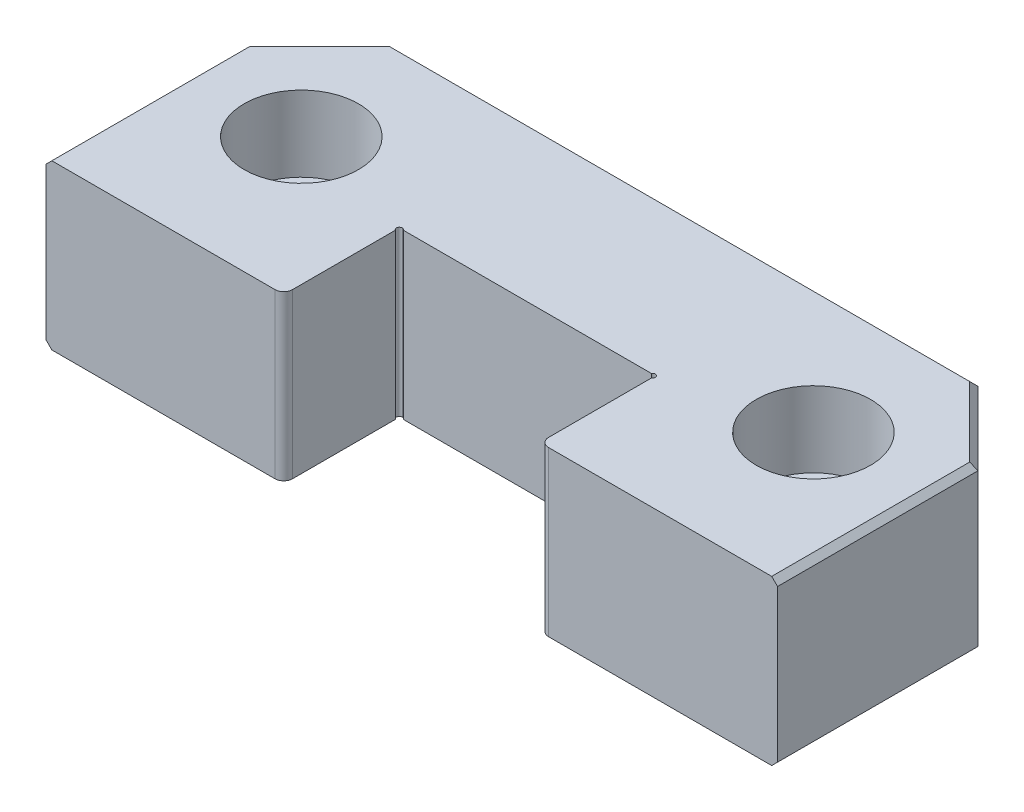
ISO-10303-21;
HEADER;
FILE_DESCRIPTION(('STEP AP214'),'2;1');
FILE_NAME('part.step','',(''),(''),'','','');
FILE_SCHEMA(('AUTOMOTIVE_DESIGN { 1 0 10303 214 1 1 1 1 }'));
ENDSEC;
DATA;
#1=APPLICATION_CONTEXT('core data for automotive mechanical design processes');
#2=APPLICATION_PROTOCOL_DEFINITION('international standard','automotive_design',2000,#1);
#3=PRODUCT_CONTEXT('',#1,'mechanical');
#4=PRODUCT('Part','Part','',(#3));
#5=PRODUCT_RELATED_PRODUCT_CATEGORY('part','',(#4));
#6=PRODUCT_DEFINITION_FORMATION('','',#4);
#7=PRODUCT_DEFINITION_CONTEXT('part definition',#1,'design');
#8=PRODUCT_DEFINITION('design','',#6,#7);
#9=PRODUCT_DEFINITION_SHAPE('','',#8);
#10=(LENGTH_UNIT() NAMED_UNIT(*) SI_UNIT(.MILLI.,.METRE.));
#11=(NAMED_UNIT(*) PLANE_ANGLE_UNIT() SI_UNIT($,.RADIAN.));
#12=(NAMED_UNIT(*) SI_UNIT($,.STERADIAN.) SOLID_ANGLE_UNIT());
#13=UNCERTAINTY_MEASURE_WITH_UNIT(LENGTH_MEASURE(1.E-05),#10,'distance_accuracy_value','');
#14=(GEOMETRIC_REPRESENTATION_CONTEXT(3) GLOBAL_UNCERTAINTY_ASSIGNED_CONTEXT((#13)) GLOBAL_UNIT_ASSIGNED_CONTEXT((#10,
#11,#12)) REPRESENTATION_CONTEXT('',''));
#15=CARTESIAN_POINT('',(0.,0.,0.));
#16=DIRECTION('',(0.,0.,1.));
#17=DIRECTION('',(1.,0.,0.));
#18=AXIS2_PLACEMENT_3D('',#15,#16,#17);
#19=CARTESIAN_POINT('',(-44.45,15.748,-25.273));
#20=DIRECTION('',(0.,-1.,0.));
#21=DIRECTION('',(0.,0.,-1.));
#22=AXIS2_PLACEMENT_3D('',#19,#20,#21);
#23=CYLINDRICAL_SURFACE('',#22,6.7437);
#24=CARTESIAN_POINT('',(-44.45,0.,-25.273));
#25=DIRECTION('',(0.,-1.,0.));
#26=DIRECTION('',(0.,0.,-1.));
#27=AXIS2_PLACEMENT_3D('',#24,#25,#26);
#28=CIRCLE('',#27,6.7437);
#29=CARTESIAN_POINT('',(-44.45,0.,-32.0167));
#30=VERTEX_POINT('',#29);
#31=EDGE_CURVE('E267',#30,#30,#28,.T.);
#32=ORIENTED_EDGE('',*,*,#31,.T.);
#33=EDGE_LOOP('',(#32));
#34=FACE_BOUND('',#33,.T.);
#35=CARTESIAN_POINT('',(-44.45,15.3416,-25.273));
#36=DIRECTION('',(0.,1.,0.));
#37=DIRECTION('',(0.,0.,1.));
#38=AXIS2_PLACEMENT_3D('',#35,#36,#37);
#39=CIRCLE('',#38,6.7437);
#40=CARTESIAN_POINT('',(-44.45,15.3416,-18.5293));
#41=VERTEX_POINT('',#40);
#42=EDGE_CURVE('E269',#41,#41,#39,.F.);
#43=ORIENTED_EDGE('',*,*,#42,.F.);
#44=EDGE_LOOP('',(#43));
#45=FACE_BOUND('',#44,.T.);
#46=ADVANCED_FACE('F32',(#34,#45),#23,.F.);
#47=CARTESIAN_POINT('',(44.45,15.748,-25.273));
#48=DIRECTION('',(0.,-1.,0.));
#49=DIRECTION('',(0.,0.,-1.));
#50=AXIS2_PLACEMENT_3D('',#47,#48,#49);
#51=CYLINDRICAL_SURFACE('',#50,6.7437);
#52=CARTESIAN_POINT('',(44.45,0.,-25.273));
#53=DIRECTION('',(0.,-1.,0.));
#54=DIRECTION('',(0.,0.,-1.));
#55=AXIS2_PLACEMENT_3D('',#52,#53,#54);
#56=CIRCLE('',#55,6.7437);
#57=CARTESIAN_POINT('',(44.45,0.,-32.0167));
#58=VERTEX_POINT('',#57);
#59=EDGE_CURVE('E178',#58,#58,#56,.T.);
#60=ORIENTED_EDGE('',*,*,#59,.T.);
#61=EDGE_LOOP('',(#60));
#62=FACE_BOUND('',#61,.T.);
#63=CARTESIAN_POINT('',(44.45,15.3416,-25.273));
#64=DIRECTION('',(0.,1.,0.));
#65=DIRECTION('',(0.,0.,1.));
#66=AXIS2_PLACEMENT_3D('',#63,#64,#65);
#67=CIRCLE('',#66,6.7437);
#68=CARTESIAN_POINT('',(44.45,15.3416,-18.5293));
#69=VERTEX_POINT('',#68);
#70=EDGE_CURVE('E264',#69,#69,#67,.F.);
#71=ORIENTED_EDGE('',*,*,#70,.F.);
#72=EDGE_LOOP('',(#71));
#73=FACE_BOUND('',#72,.T.);
#74=ADVANCED_FACE('F427',(#62,#73),#51,.F.);
#75=CARTESIAN_POINT('',(-63.5,28.448,0.));
#76=DIRECTION('',(0.,0.,-1.));
#77=DIRECTION('',(-1.,0.,0.));
#78=AXIS2_PLACEMENT_3D('',#75,#76,#77);
#79=PLANE('',#78);
#80=DIRECTION('',(0.,-1.,0.));
#81=VECTOR('',#80,1.);
#82=CARTESIAN_POINT('',(63.5,28.448,0.));
#83=LINE('',#82,#81);
#84=CARTESIAN_POINT('',(63.5,27.432,0.));
#85=VERTEX_POINT('',#84);
#86=CARTESIAN_POINT('',(63.5,1.01599999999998,0.));
#87=VERTEX_POINT('',#86);
#88=EDGE_CURVE('E213',#85,#87,#83,.T.);
#89=ORIENTED_EDGE('',*,*,#88,.F.);
#90=DIRECTION('',(-0.707106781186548,0.707106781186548,0.));
#91=VECTOR('',#90,1.);
#92=CARTESIAN_POINT('',(62.484,28.448,0.));
#93=LINE('',#92,#91);
#94=CARTESIAN_POINT('',(62.4839999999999,28.448,0.));
#95=VERTEX_POINT('',#94);
#96=EDGE_CURVE('E311',#85,#95,#93,.T.);
#97=ORIENTED_EDGE('',*,*,#96,.T.);
#98=DIRECTION('',(1.,0.,0.));
#99=VECTOR('',#98,1.);
#100=CARTESIAN_POINT('',(-63.5,28.448,0.));
#101=LINE('',#100,#99);
#102=CARTESIAN_POINT('',(23.749,28.448,0.));
#103=VERTEX_POINT('',#102);
#104=EDGE_CURVE('E214',#103,#95,#101,.T.);
#105=ORIENTED_EDGE('',*,*,#104,.F.);
#106=DIRECTION('',(0.,-1.,0.));
#107=VECTOR('',#106,1.);
#108=CARTESIAN_POINT('',(23.749,28.448,0.));
#109=LINE('',#108,#107);
#110=CARTESIAN_POINT('',(23.749,0.,0.));
#111=VERTEX_POINT('',#110);
#112=EDGE_CURVE('E258',#103,#111,#109,.T.);
#113=ORIENTED_EDGE('',*,*,#112,.T.);
#114=DIRECTION('',(1.,0.,0.));
#115=VECTOR('',#114,1.);
#116=CARTESIAN_POINT('',(-63.5,0.,0.));
#117=LINE('',#116,#115);
#118=CARTESIAN_POINT('',(62.484,0.,0.));
#119=VERTEX_POINT('',#118);
#120=EDGE_CURVE('E206',#111,#119,#117,.T.);
#121=ORIENTED_EDGE('',*,*,#120,.T.);
#122=DIRECTION('',(-0.707106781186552,-0.707106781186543,0.));
#123=VECTOR('',#122,1.);
#124=CARTESIAN_POINT('',(63.5,1.016,0.));
#125=LINE('',#124,#123);
#126=EDGE_CURVE('E309',#119,#87,#125,.F.);
#127=ORIENTED_EDGE('',*,*,#126,.T.);
#128=EDGE_LOOP('',(#89,#97,#105,#113,#121,#127));
#129=FACE_BOUND('',#128,.T.);
#130=ADVANCED_FACE('F400',(#129),#79,.F.);
#131=CARTESIAN_POINT('',(-63.5,28.448,-47.498));
#132=DIRECTION('',(1.,0.,0.));
#133=DIRECTION('',(0.,0.,-1.));
#134=AXIS2_PLACEMENT_3D('',#131,#132,#133);
#135=PLANE('',#134);
#136=DIRECTION('',(0.,-1.,0.));
#137=VECTOR('',#136,1.);
#138=CARTESIAN_POINT('',(-63.5,28.448,0.));
#139=LINE('',#138,#137);
#140=CARTESIAN_POINT('',(-63.5,27.432,0.));
#141=VERTEX_POINT('',#140);
#142=CARTESIAN_POINT('',(-63.5,1.01599999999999,0.));
#143=VERTEX_POINT('',#142);
#144=EDGE_CURVE('E219',#141,#143,#139,.T.);
#145=ORIENTED_EDGE('',*,*,#144,.F.);
#146=DIRECTION('',(0.,0.,-1.));
#147=VECTOR('',#146,1.);
#148=CARTESIAN_POINT('',(-63.5,27.432,-34.798));
#149=LINE('',#148,#147);
#150=CARTESIAN_POINT('',(-63.5,27.432,-34.798));
#151=VERTEX_POINT('',#150);
#152=EDGE_CURVE('E290',#141,#151,#149,.T.);
#153=ORIENTED_EDGE('',*,*,#152,.T.);
#154=DIRECTION('',(0.,-1.,0.));
#155=VECTOR('',#154,1.);
#156=CARTESIAN_POINT('',(-63.5,28.448,-34.798));
#157=LINE('',#156,#155);
#158=CARTESIAN_POINT('',(-63.5,1.01599999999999,-34.798));
#159=VERTEX_POINT('',#158);
#160=EDGE_CURVE('E231',#151,#159,#157,.T.);
#161=ORIENTED_EDGE('',*,*,#160,.T.);
#162=DIRECTION('',(0.,0.,1.));
#163=VECTOR('',#162,1.);
#164=CARTESIAN_POINT('',(-63.5,1.01599999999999,-47.498));
#165=LINE('',#164,#163);
#166=EDGE_CURVE('E288',#159,#143,#165,.T.);
#167=ORIENTED_EDGE('',*,*,#166,.T.);
#168=EDGE_LOOP('',(#145,#153,#161,#167));
#169=FACE_BOUND('',#168,.T.);
#170=ADVANCED_FACE('F353',(#169),#135,.F.);
#171=CARTESIAN_POINT('',(-62.484,28.448,0.));
#172=VERTEX_POINT('',#171);
#173=CARTESIAN_POINT('',(-23.749,28.448,0.));
#174=VERTEX_POINT('',#173);
#175=EDGE_CURVE('E211',#172,#174,#101,.T.);
#176=ORIENTED_EDGE('',*,*,#175,.F.);
#177=DIRECTION('',(-0.707106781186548,-0.707106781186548,0.));
#178=VECTOR('',#177,1.);
#179=CARTESIAN_POINT('',(-62.484,28.448,0.));
#180=LINE('',#179,#178);
#181=EDGE_CURVE('E286',#172,#141,#180,.T.);
#182=ORIENTED_EDGE('',*,*,#181,.T.);
#183=ORIENTED_EDGE('',*,*,#144,.T.);
#184=DIRECTION('',(-0.707106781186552,0.707106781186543,0.));
#185=VECTOR('',#184,1.);
#186=CARTESIAN_POINT('',(-63.5,1.01599999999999,0.));
#187=LINE('',#186,#185);
#188=CARTESIAN_POINT('',(-62.484,0.,0.));
#189=VERTEX_POINT('',#188);
#190=EDGE_CURVE('E284',#143,#189,#187,.F.);
#191=ORIENTED_EDGE('',*,*,#190,.T.);
#192=CARTESIAN_POINT('',(-23.749,0.,0.));
#193=VERTEX_POINT('',#192);
#194=EDGE_CURVE('E215',#189,#193,#117,.T.);
#195=ORIENTED_EDGE('',*,*,#194,.T.);
#196=DIRECTION('',(0.,1.,0.));
#197=VECTOR('',#196,1.);
#198=CARTESIAN_POINT('',(-23.749,28.448,0.));
#199=LINE('',#198,#197);
#200=EDGE_CURVE('E245',#193,#174,#199,.T.);
#201=ORIENTED_EDGE('',*,*,#200,.T.);
#202=EDGE_LOOP('',(#176,#182,#183,#191,#195,#201));
#203=FACE_BOUND('',#202,.T.);
#204=ADVANCED_FACE('F358',(#203),#79,.F.);
#205=CARTESIAN_POINT('',(63.5,28.448,-47.498));
#206=DIRECTION('',(-1.,0.,0.));
#207=DIRECTION('',(0.,0.,1.));
#208=AXIS2_PLACEMENT_3D('',#205,#206,#207);
#209=PLANE('',#208);
#210=DIRECTION('',(0.,1.,0.));
#211=VECTOR('',#210,1.);
#212=CARTESIAN_POINT('',(63.5,28.448,-34.7979999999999));
#213=LINE('',#212,#211);
#214=CARTESIAN_POINT('',(63.5,1.01599999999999,-34.7979999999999));
#215=VERTEX_POINT('',#214);
#216=CARTESIAN_POINT('',(63.5,27.432,-34.7979999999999));
#217=VERTEX_POINT('',#216);
#218=EDGE_CURVE('E228',#215,#217,#213,.T.);
#219=ORIENTED_EDGE('',*,*,#218,.T.);
#220=DIRECTION('',(0.,0.,1.));
#221=VECTOR('',#220,1.);
#222=CARTESIAN_POINT('',(63.5,27.432,0.));
#223=LINE('',#222,#221);
#224=EDGE_CURVE('E307',#217,#85,#223,.T.);
#225=ORIENTED_EDGE('',*,*,#224,.T.);
#226=ORIENTED_EDGE('',*,*,#88,.T.);
#227=DIRECTION('',(0.,0.,-1.));
#228=VECTOR('',#227,1.);
#229=CARTESIAN_POINT('',(63.5,1.01599999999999,-47.498));
#230=LINE('',#229,#228);
#231=EDGE_CURVE('E304',#87,#215,#230,.T.);
#232=ORIENTED_EDGE('',*,*,#231,.T.);
#233=EDGE_LOOP('',(#219,#225,#226,#232));
#234=FACE_BOUND('',#233,.T.);
#235=ADVANCED_FACE('F390',(#234),#209,.F.);
#236=CARTESIAN_POINT('',(-63.5,28.448,-47.498));
#237=DIRECTION('',(0.,0.,1.));
#238=DIRECTION('',(1.,0.,0.));
#239=AXIS2_PLACEMENT_3D('',#236,#237,#238);
#240=PLANE('',#239);
#241=DIRECTION('',(0.,1.,0.));
#242=VECTOR('',#241,1.);
#243=CARTESIAN_POINT('',(-50.7999999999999,28.448,-47.498));
#244=LINE('',#243,#242);
#245=CARTESIAN_POINT('',(-50.7999999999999,1.01599999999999,-47.498));
#246=VERTEX_POINT('',#245);
#247=CARTESIAN_POINT('',(-50.7999999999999,27.432,-47.498));
#248=VERTEX_POINT('',#247);
#249=EDGE_CURVE('E222',#246,#248,#244,.T.);
#250=ORIENTED_EDGE('',*,*,#249,.T.);
#251=DIRECTION('',(1.,0.,0.));
#252=VECTOR('',#251,1.);
#253=CARTESIAN_POINT('',(50.8,27.432,-47.498));
#254=LINE('',#253,#252);
#255=CARTESIAN_POINT('',(50.8,27.432,-47.498));
#256=VERTEX_POINT('',#255);
#257=EDGE_CURVE('E298',#248,#256,#254,.T.);
#258=ORIENTED_EDGE('',*,*,#257,.T.);
#259=DIRECTION('',(0.,-1.,0.));
#260=VECTOR('',#259,1.);
#261=CARTESIAN_POINT('',(50.8,28.448,-47.498));
#262=LINE('',#261,#260);
#263=CARTESIAN_POINT('',(50.8,1.01599999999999,-47.498));
#264=VERTEX_POINT('',#263);
#265=EDGE_CURVE('E225',#256,#264,#262,.T.);
#266=ORIENTED_EDGE('',*,*,#265,.T.);
#267=DIRECTION('',(-1.,0.,0.));
#268=VECTOR('',#267,1.);
#269=CARTESIAN_POINT('',(-63.5,1.01599999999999,-47.498));
#270=LINE('',#269,#268);
#271=EDGE_CURVE('E296',#264,#246,#270,.T.);
#272=ORIENTED_EDGE('',*,*,#271,.T.);
#273=EDGE_LOOP('',(#250,#258,#266,#272));
#274=FACE_BOUND('',#273,.T.);
#275=ADVANCED_FACE('F375',(#274),#240,.F.);
#276=CARTESIAN_POINT('',(-63.5,28.448,0.));
#277=DIRECTION('',(0.,1.,0.));
#278=DIRECTION('',(0.,0.,1.));
#279=AXIS2_PLACEMENT_3D('',#276,#277,#278);
#280=PLANE('',#279);
#281=CARTESIAN_POINT('',(-44.45,28.448,-25.273));
#282=DIRECTION('',(0.,1.,0.));
#283=DIRECTION('',(0.,0.,1.));
#284=AXIS2_PLACEMENT_3D('',#281,#282,#283);
#285=CIRCLE('',#284,9.9187);
#286=CARTESIAN_POINT('',(-44.45,28.448,-15.3543));
#287=VERTEX_POINT('',#286);
#288=EDGE_CURVE('E331',#287,#287,#285,.T.);
#289=ORIENTED_EDGE('',*,*,#288,.F.);
#290=EDGE_LOOP('',(#289));
#291=FACE_BOUND('',#290,.T.);
#292=CARTESIAN_POINT('',(44.45,28.448,-25.273));
#293=DIRECTION('',(0.,1.,0.));
#294=DIRECTION('',(0.,0.,1.));
#295=AXIS2_PLACEMENT_3D('',#292,#293,#294);
#296=CIRCLE('',#295,9.9187);
#297=CARTESIAN_POINT('',(44.45,28.448,-15.3543));
#298=VERTEX_POINT('',#297);
#299=EDGE_CURVE('E272',#298,#298,#296,.T.);
#300=ORIENTED_EDGE('',*,*,#299,.F.);
#301=EDGE_LOOP('',(#300));
#302=FACE_BOUND('',#301,.T.);
#303=DIRECTION('',(-0.707106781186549,0.,0.707106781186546));
#304=VECTOR('',#303,1.);
#305=CARTESIAN_POINT('',(-80.1805795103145,28.448,-16.6805795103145));
#306=LINE('',#305,#304);
#307=CARTESIAN_POINT('',(-50.3791590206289,28.448,-46.482));
#308=VERTEX_POINT('',#307);
#309=CARTESIAN_POINT('',(-62.484,28.448,-34.3771590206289));
#310=VERTEX_POINT('',#309);
#311=EDGE_CURVE('E279',#308,#310,#306,.T.);
#312=ORIENTED_EDGE('',*,*,#311,.T.);
#313=DIRECTION('',(0.,0.,1.));
#314=VECTOR('',#313,1.);
#315=CARTESIAN_POINT('',(-62.484,28.448,0.));
#316=LINE('',#315,#314);
#317=EDGE_CURVE('E281',#310,#172,#316,.T.);
#318=ORIENTED_EDGE('',*,*,#317,.T.);
#319=ORIENTED_EDGE('',*,*,#175,.T.);
#320=CARTESIAN_POINT('',(-23.749,28.448,-1.524));
#321=DIRECTION('',(0.,1.,0.));
#322=DIRECTION('',(0.,0.,1.));
#323=AXIS2_PLACEMENT_3D('',#320,#321,#322);
#324=CIRCLE('',#323,1.524);
#325=CARTESIAN_POINT('',(-22.225,28.448,-1.524));
#326=VERTEX_POINT('',#325);
#327=EDGE_CURVE('E175',#174,#326,#324,.T.);
#328=ORIENTED_EDGE('',*,*,#327,.T.);
#329=DIRECTION('',(0.,0.,-1.));
#330=VECTOR('',#329,1.);
#331=CARTESIAN_POINT('',(-22.225,28.448,-19.3720590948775));
#332=LINE('',#331,#330);
#333=CARTESIAN_POINT('',(-22.225,28.448,-19.3720590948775));
#334=VERTEX_POINT('',#333);
#335=EDGE_CURVE('E168',#326,#334,#332,.T.);
#336=ORIENTED_EDGE('',*,*,#335,.T.);
#337=CARTESIAN_POINT('',(-21.971,28.448,-19.812));
#338=DIRECTION('',(0.,-1.,0.));
#339=DIRECTION('',(0.,0.,-1.));
#340=AXIS2_PLACEMENT_3D('',#337,#338,#339);
#341=CIRCLE('',#340,0.508);
#342=CARTESIAN_POINT('',(-21.5310590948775,28.448,-20.066));
#343=VERTEX_POINT('',#342);
#344=EDGE_CURVE('E173',#334,#343,#341,.T.);
#345=ORIENTED_EDGE('',*,*,#344,.T.);
#346=DIRECTION('',(1.,0.,0.));
#347=VECTOR('',#346,1.);
#348=CARTESIAN_POINT('',(-21.5310590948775,28.448,-20.066));
#349=LINE('',#348,#347);
#350=CARTESIAN_POINT('',(21.5310590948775,28.448,-20.066));
#351=VERTEX_POINT('',#350);
#352=EDGE_CURVE('E193',#343,#351,#349,.T.);
#353=ORIENTED_EDGE('',*,*,#352,.T.);
#354=CARTESIAN_POINT('',(21.971,28.448,-19.812));
#355=DIRECTION('',(0.,-1.,0.));
#356=DIRECTION('',(0.,0.,-1.));
#357=AXIS2_PLACEMENT_3D('',#354,#355,#356);
#358=CIRCLE('',#357,0.508000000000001);
#359=CARTESIAN_POINT('',(22.225,28.448,-19.3720590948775));
#360=VERTEX_POINT('',#359);
#361=EDGE_CURVE('E195',#351,#360,#358,.T.);
#362=ORIENTED_EDGE('',*,*,#361,.T.);
#363=DIRECTION('',(0.,0.,1.));
#364=VECTOR('',#363,1.);
#365=CARTESIAN_POINT('',(22.225,28.448,-19.3720590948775));
#366=LINE('',#365,#364);
#367=CARTESIAN_POINT('',(22.225,28.448,-1.524));
#368=VERTEX_POINT('',#367);
#369=EDGE_CURVE('E188',#360,#368,#366,.T.);
#370=ORIENTED_EDGE('',*,*,#369,.T.);
#371=CARTESIAN_POINT('',(23.749,28.448,-1.524));
#372=DIRECTION('',(0.,1.,0.));
#373=DIRECTION('',(0.,0.,1.));
#374=AXIS2_PLACEMENT_3D('',#371,#372,#373);
#375=CIRCLE('',#374,1.524);
#376=EDGE_CURVE('E248',#368,#103,#375,.T.);
#377=ORIENTED_EDGE('',*,*,#376,.T.);
#378=ORIENTED_EDGE('',*,*,#104,.T.);
#379=DIRECTION('',(0.,0.,-1.));
#380=VECTOR('',#379,1.);
#381=CARTESIAN_POINT('',(62.484,28.448,-34.7979999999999));
#382=LINE('',#381,#380);
#383=CARTESIAN_POINT('',(62.484,28.448,-34.3771590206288));
#384=VERTEX_POINT('',#383);
#385=EDGE_CURVE('E263',#95,#384,#382,.T.);
#386=ORIENTED_EDGE('',*,*,#385,.T.);
#387=DIRECTION('',(-0.707106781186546,0.,-0.707106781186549));
#388=VECTOR('',#387,1.);
#389=CARTESIAN_POINT('',(16.6805795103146,28.448,-80.1805795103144));
#390=LINE('',#389,#388);
#391=CARTESIAN_POINT('',(50.3791590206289,28.448,-46.482));
#392=VERTEX_POINT('',#391);
#393=EDGE_CURVE('E275',#384,#392,#390,.T.);
#394=ORIENTED_EDGE('',*,*,#393,.T.);
#395=DIRECTION('',(-1.,0.,0.));
#396=VECTOR('',#395,1.);
#397=CARTESIAN_POINT('',(-50.7999999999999,28.448,-46.482));
#398=LINE('',#397,#396);
#399=EDGE_CURVE('E277',#392,#308,#398,.T.);
#400=ORIENTED_EDGE('',*,*,#399,.T.);
#401=EDGE_LOOP('',(#312,#318,#319,#328,#336,#345,#353,#362,#370,#377,#378,#386,#394,#400));
#402=FACE_BOUND('',#401,.T.);
#403=ADVANCED_FACE('F170',(#291,#302,#402),#280,.T.);
#404=CARTESIAN_POINT('',(-63.5,0.,0.));
#405=DIRECTION('',(0.,1.,0.));
#406=DIRECTION('',(0.,0.,1.));
#407=AXIS2_PLACEMENT_3D('',#404,#405,#406);
#408=PLANE('',#407);
#409=ORIENTED_EDGE('',*,*,#31,.F.);
#410=EDGE_LOOP('',(#409));
#411=FACE_BOUND('',#410,.T.);
#412=ORIENTED_EDGE('',*,*,#59,.F.);
#413=EDGE_LOOP('',(#412));
#414=FACE_BOUND('',#413,.T.);
#415=DIRECTION('',(0.707106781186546,0.,0.707106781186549));
#416=VECTOR('',#415,1.);
#417=CARTESIAN_POINT('',(62.7815795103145,0.,-34.0795795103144));
#418=LINE('',#417,#416);
#419=CARTESIAN_POINT('',(50.3791590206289,0.,-46.482));
#420=VERTEX_POINT('',#419);
#421=CARTESIAN_POINT('',(62.484,0.,-34.3771590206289));
#422=VERTEX_POINT('',#421);
#423=EDGE_CURVE('E41',#420,#422,#418,.T.);
#424=ORIENTED_EDGE('',*,*,#423,.T.);
#425=DIRECTION('',(0.,0.,1.));
#426=VECTOR('',#425,1.);
#427=CARTESIAN_POINT('',(62.484,0.,0.));
#428=LINE('',#427,#426);
#429=EDGE_CURVE('E11',#422,#119,#428,.T.);
#430=ORIENTED_EDGE('',*,*,#429,.T.);
#431=ORIENTED_EDGE('',*,*,#120,.F.);
#432=CARTESIAN_POINT('',(23.749,0.,-1.524));
#433=DIRECTION('',(0.,1.,0.));
#434=DIRECTION('',(0.,0.,1.));
#435=AXIS2_PLACEMENT_3D('',#432,#433,#434);
#436=CIRCLE('',#435,1.524);
#437=CARTESIAN_POINT('',(22.225,0.,-1.524));
#438=VERTEX_POINT('',#437);
#439=EDGE_CURVE('E253',#111,#438,#436,.F.);
#440=ORIENTED_EDGE('',*,*,#439,.T.);
#441=DIRECTION('',(0.,0.,-1.));
#442=VECTOR('',#441,1.);
#443=CARTESIAN_POINT('',(22.225,0.,0.));
#444=LINE('',#443,#442);
#445=CARTESIAN_POINT('',(22.225,0.,-19.3720590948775));
#446=VERTEX_POINT('',#445);
#447=EDGE_CURVE('E243',#438,#446,#444,.T.);
#448=ORIENTED_EDGE('',*,*,#447,.T.);
#449=CARTESIAN_POINT('',(21.971,0.,-19.812));
#450=DIRECTION('',(0.,1.,0.));
#451=DIRECTION('',(0.,0.,1.));
#452=AXIS2_PLACEMENT_3D('',#449,#450,#451);
#453=CIRCLE('',#452,0.508000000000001);
#454=CARTESIAN_POINT('',(21.5310590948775,0.,-20.066));
#455=VERTEX_POINT('',#454);
#456=EDGE_CURVE('E240',#446,#455,#453,.T.);
#457=ORIENTED_EDGE('',*,*,#456,.T.);
#458=DIRECTION('',(-1.,0.,0.));
#459=VECTOR('',#458,1.);
#460=CARTESIAN_POINT('',(-63.5,0.,-20.066));
#461=LINE('',#460,#459);
#462=CARTESIAN_POINT('',(-21.5310590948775,0.,-20.066));
#463=VERTEX_POINT('',#462);
#464=EDGE_CURVE('E237',#455,#463,#461,.T.);
#465=ORIENTED_EDGE('',*,*,#464,.T.);
#466=CARTESIAN_POINT('',(-21.971,0.,-19.812));
#467=DIRECTION('',(0.,1.,0.));
#468=DIRECTION('',(0.,0.,1.));
#469=AXIS2_PLACEMENT_3D('',#466,#467,#468);
#470=CIRCLE('',#469,0.508);
#471=CARTESIAN_POINT('',(-22.225,0.,-19.3720590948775));
#472=VERTEX_POINT('',#471);
#473=EDGE_CURVE('E235',#463,#472,#470,.T.);
#474=ORIENTED_EDGE('',*,*,#473,.T.);
#475=DIRECTION('',(0.,0.,1.));
#476=VECTOR('',#475,1.);
#477=CARTESIAN_POINT('',(-22.225,0.,0.));
#478=LINE('',#477,#476);
#479=CARTESIAN_POINT('',(-22.225,0.,-1.524));
#480=VERTEX_POINT('',#479);
#481=EDGE_CURVE('E184',#472,#480,#478,.T.);
#482=ORIENTED_EDGE('',*,*,#481,.T.);
#483=CARTESIAN_POINT('',(-23.749,0.,-1.524));
#484=DIRECTION('',(0.,1.,0.));
#485=DIRECTION('',(0.,0.,1.));
#486=AXIS2_PLACEMENT_3D('',#483,#484,#485);
#487=CIRCLE('',#486,1.524);
#488=EDGE_CURVE('E255',#480,#193,#487,.F.);
#489=ORIENTED_EDGE('',*,*,#488,.T.);
#490=ORIENTED_EDGE('',*,*,#194,.F.);
#491=DIRECTION('',(0.,0.,-1.));
#492=VECTOR('',#491,1.);
#493=CARTESIAN_POINT('',(-62.484,0.,0.));
#494=LINE('',#493,#492);
#495=CARTESIAN_POINT('',(-62.484,0.,-34.3771590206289));
#496=VERTEX_POINT('',#495);
#497=EDGE_CURVE('E313',#189,#496,#494,.T.);
#498=ORIENTED_EDGE('',*,*,#497,.T.);
#499=DIRECTION('',(0.707106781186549,0.,-0.707106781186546));
#500=VECTOR('',#499,1.);
#501=CARTESIAN_POINT('',(-50.0815795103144,0.,-46.7795795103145));
#502=LINE('',#501,#500);
#503=CARTESIAN_POINT('',(-50.3791590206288,0.,-46.482));
#504=VERTEX_POINT('',#503);
#505=EDGE_CURVE('E315',#496,#504,#502,.T.);
#506=ORIENTED_EDGE('',*,*,#505,.T.);
#507=DIRECTION('',(1.,0.,0.));
#508=VECTOR('',#507,1.);
#509=CARTESIAN_POINT('',(-63.5,0.,-46.482));
#510=LINE('',#509,#508);
#511=EDGE_CURVE('E52',#504,#420,#510,.T.);
#512=ORIENTED_EDGE('',*,*,#511,.T.);
#513=EDGE_LOOP('',(#424,#430,#431,#440,#448,#457,#465,#474,#482,#489,#490,#498,#506,#512));
#514=FACE_BOUND('',#513,.T.);
#515=ADVANCED_FACE('F410',(#411,#414,#514),#408,.F.);
#516=CARTESIAN_POINT('',(50.8,28.448,-47.498));
#517=DIRECTION('',(-0.707106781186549,0.,0.707106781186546));
#518=DIRECTION('',(0.707106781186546,0.,0.707106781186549));
#519=AXIS2_PLACEMENT_3D('',#516,#517,#518);
#520=PLANE('',#519);
#521=ORIENTED_EDGE('',*,*,#265,.F.);
#522=DIRECTION('',(-0.707106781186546,0.,-0.707106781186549));
#523=VECTOR('',#522,1.);
#524=CARTESIAN_POINT('',(50.8,27.432,-47.498));
#525=LINE('',#524,#523);
#526=EDGE_CURVE('E302',#256,#217,#525,.F.);
#527=ORIENTED_EDGE('',*,*,#526,.T.);
#528=ORIENTED_EDGE('',*,*,#218,.F.);
#529=DIRECTION('',(0.707106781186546,0.,0.707106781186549));
#530=VECTOR('',#529,1.);
#531=CARTESIAN_POINT('',(50.8,1.01599999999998,-47.498));
#532=LINE('',#531,#530);
#533=EDGE_CURVE('E300',#215,#264,#532,.F.);
#534=ORIENTED_EDGE('',*,*,#533,.T.);
#535=EDGE_LOOP('',(#521,#527,#528,#534));
#536=FACE_BOUND('',#535,.T.);
#537=ADVANCED_FACE('F387',(#536),#520,.F.);
#538=CARTESIAN_POINT('',(-63.5,28.448,-34.798));
#539=DIRECTION('',(0.707106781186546,0.,0.707106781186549));
#540=DIRECTION('',(0.707106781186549,0.,-0.707106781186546));
#541=AXIS2_PLACEMENT_3D('',#538,#539,#540);
#542=PLANE('',#541);
#543=ORIENTED_EDGE('',*,*,#160,.F.);
#544=DIRECTION('',(-0.707106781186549,0.,0.707106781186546));
#545=VECTOR('',#544,1.);
#546=CARTESIAN_POINT('',(-63.5,27.432,-34.798));
#547=LINE('',#546,#545);
#548=EDGE_CURVE('E294',#151,#248,#547,.F.);
#549=ORIENTED_EDGE('',*,*,#548,.T.);
#550=ORIENTED_EDGE('',*,*,#249,.F.);
#551=DIRECTION('',(0.707106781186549,0.,-0.707106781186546));
#552=VECTOR('',#551,1.);
#553=CARTESIAN_POINT('',(-63.5,1.01599999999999,-34.798));
#554=LINE('',#553,#552);
#555=EDGE_CURVE('E292',#246,#159,#554,.F.);
#556=ORIENTED_EDGE('',*,*,#555,.T.);
#557=EDGE_LOOP('',(#543,#549,#550,#556));
#558=FACE_BOUND('',#557,.T.);
#559=ADVANCED_FACE('F372',(#558),#542,.F.);
#560=CARTESIAN_POINT('',(22.225,28.448,-19.3720590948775));
#561=DIRECTION('',(1.,0.,0.));
#562=DIRECTION('',(0.,0.,-1.));
#563=AXIS2_PLACEMENT_3D('',#560,#561,#562);
#564=PLANE('',#563);
#565=ORIENTED_EDGE('',*,*,#447,.F.);
#566=DIRECTION('',(0.,-1.,0.));
#567=VECTOR('',#566,1.);
#568=CARTESIAN_POINT('',(22.225,28.448,-1.524));
#569=LINE('',#568,#567);
#570=EDGE_CURVE('E261',#438,#368,#569,.F.);
#571=ORIENTED_EDGE('',*,*,#570,.T.);
#572=ORIENTED_EDGE('',*,*,#369,.F.);
#573=DIRECTION('',(0.,-1.,0.));
#574=VECTOR('',#573,1.);
#575=CARTESIAN_POINT('',(22.225,28.448,-19.3720590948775));
#576=LINE('',#575,#574);
#577=EDGE_CURVE('E203',#360,#446,#576,.T.);
#578=ORIENTED_EDGE('',*,*,#577,.T.);
#579=EDGE_LOOP('',(#565,#571,#572,#578));
#580=FACE_BOUND('',#579,.T.);
#581=ADVANCED_FACE('F441',(#580),#564,.F.);
#582=CARTESIAN_POINT('',(21.971,28.448,-19.812));
#583=DIRECTION('',(0.,-1.,0.));
#584=DIRECTION('',(0.,0.,-1.));
#585=AXIS2_PLACEMENT_3D('',#582,#583,#584);
#586=CYLINDRICAL_SURFACE('',#585,0.508000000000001);
#587=ORIENTED_EDGE('',*,*,#577,.F.);
#588=ORIENTED_EDGE('',*,*,#361,.F.);
#589=DIRECTION('',(0.,-1.,0.));
#590=VECTOR('',#589,1.);
#591=CARTESIAN_POINT('',(21.5310590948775,28.448,-20.066));
#592=LINE('',#591,#590);
#593=EDGE_CURVE('E207',#351,#455,#592,.T.);
#594=ORIENTED_EDGE('',*,*,#593,.T.);
#595=ORIENTED_EDGE('',*,*,#456,.F.);
#596=EDGE_LOOP('',(#587,#588,#594,#595));
#597=FACE_BOUND('',#596,.T.);
#598=ADVANCED_FACE('F444',(#597),#586,.F.);
#599=CARTESIAN_POINT('',(-21.5310590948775,28.448,-20.066));
#600=DIRECTION('',(0.,0.,-1.));
#601=DIRECTION('',(-1.,0.,0.));
#602=AXIS2_PLACEMENT_3D('',#599,#600,#601);
#603=PLANE('',#602);
#604=ORIENTED_EDGE('',*,*,#593,.F.);
#605=ORIENTED_EDGE('',*,*,#352,.F.);
#606=DIRECTION('',(0.,-1.,0.));
#607=VECTOR('',#606,1.);
#608=CARTESIAN_POINT('',(-21.5310590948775,28.448,-20.066));
#609=LINE('',#608,#607);
#610=EDGE_CURVE('E187',#343,#463,#609,.T.);
#611=ORIENTED_EDGE('',*,*,#610,.T.);
#612=ORIENTED_EDGE('',*,*,#464,.F.);
#613=EDGE_LOOP('',(#604,#605,#611,#612));
#614=FACE_BOUND('',#613,.T.);
#615=ADVANCED_FACE('F448',(#614),#603,.F.);
#616=CARTESIAN_POINT('',(-21.971,28.448,-19.812));
#617=DIRECTION('',(0.,-1.,0.));
#618=DIRECTION('',(0.,0.,-1.));
#619=AXIS2_PLACEMENT_3D('',#616,#617,#618);
#620=CYLINDRICAL_SURFACE('',#619,0.508);
#621=ORIENTED_EDGE('',*,*,#610,.F.);
#622=ORIENTED_EDGE('',*,*,#344,.F.);
#623=DIRECTION('',(0.,-1.,0.));
#624=VECTOR('',#623,1.);
#625=CARTESIAN_POINT('',(-22.225,28.448,-19.3720590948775));
#626=LINE('',#625,#624);
#627=EDGE_CURVE('E181',#334,#472,#626,.T.);
#628=ORIENTED_EDGE('',*,*,#627,.T.);
#629=ORIENTED_EDGE('',*,*,#473,.F.);
#630=EDGE_LOOP('',(#621,#622,#628,#629));
#631=FACE_BOUND('',#630,.T.);
#632=ADVANCED_FACE('F190',(#631),#620,.F.);
#633=CARTESIAN_POINT('',(-22.225,28.448,-19.3720590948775));
#634=DIRECTION('',(-1.,0.,0.));
#635=DIRECTION('',(0.,0.,1.));
#636=AXIS2_PLACEMENT_3D('',#633,#634,#635);
#637=PLANE('',#636);
#638=ORIENTED_EDGE('',*,*,#335,.F.);
#639=DIRECTION('',(0.,1.,0.));
#640=VECTOR('',#639,1.);
#641=CARTESIAN_POINT('',(-22.225,28.448,-1.524));
#642=LINE('',#641,#640);
#643=EDGE_CURVE('E251',#326,#480,#642,.F.);
#644=ORIENTED_EDGE('',*,*,#643,.T.);
#645=ORIENTED_EDGE('',*,*,#481,.F.);
#646=ORIENTED_EDGE('',*,*,#627,.F.);
#647=EDGE_LOOP('',(#638,#644,#645,#646));
#648=FACE_BOUND('',#647,.T.);
#649=ADVANCED_FACE('F182',(#648),#637,.F.);
#650=CARTESIAN_POINT('',(-23.749,28.448,-1.524));
#651=DIRECTION('',(0.,1.,0.));
#652=DIRECTION('',(0.,0.,1.));
#653=AXIS2_PLACEMENT_3D('',#650,#651,#652);
#654=CYLINDRICAL_SURFACE('',#653,1.524);
#655=ORIENTED_EDGE('',*,*,#488,.F.);
#656=ORIENTED_EDGE('',*,*,#643,.F.);
#657=ORIENTED_EDGE('',*,*,#327,.F.);
#658=ORIENTED_EDGE('',*,*,#200,.F.);
#659=EDGE_LOOP('',(#655,#656,#657,#658));
#660=FACE_BOUND('',#659,.T.);
#661=ADVANCED_FACE('F457',(#660),#654,.T.);
#662=CARTESIAN_POINT('',(23.749,28.448,-1.524));
#663=DIRECTION('',(0.,-1.,0.));
#664=DIRECTION('',(0.,0.,-1.));
#665=AXIS2_PLACEMENT_3D('',#662,#663,#664);
#666=CYLINDRICAL_SURFACE('',#665,1.524);
#667=ORIENTED_EDGE('',*,*,#376,.F.);
#668=ORIENTED_EDGE('',*,*,#570,.F.);
#669=ORIENTED_EDGE('',*,*,#439,.F.);
#670=ORIENTED_EDGE('',*,*,#112,.F.);
#671=EDGE_LOOP('',(#667,#668,#669,#670));
#672=FACE_BOUND('',#671,.T.);
#673=ADVANCED_FACE('F406',(#672),#666,.T.);
#674=CARTESIAN_POINT('',(44.45,15.3416,-25.273));
#675=DIRECTION('',(0.,1.,0.));
#676=DIRECTION('',(0.,0.,1.));
#677=AXIS2_PLACEMENT_3D('',#674,#675,#676);
#678=PLANE('',#677);
#679=CARTESIAN_POINT('',(44.45,15.3416,-25.273));
#680=DIRECTION('',(0.,1.,0.));
#681=DIRECTION('',(0.,0.,1.));
#682=AXIS2_PLACEMENT_3D('',#679,#680,#681);
#683=CIRCLE('',#682,9.9187);
#684=CARTESIAN_POINT('',(44.45,15.3416,-15.3543));
#685=VERTEX_POINT('',#684);
#686=EDGE_CURVE('E268',#685,#685,#683,.T.);
#687=ORIENTED_EDGE('',*,*,#686,.T.);
#688=EDGE_LOOP('',(#687));
#689=FACE_BOUND('',#688,.T.);
#690=ORIENTED_EDGE('',*,*,#70,.T.);
#691=EDGE_LOOP('',(#690));
#692=FACE_BOUND('',#691,.T.);
#693=ADVANCED_FACE('F481',(#689,#692),#678,.T.);
#694=CARTESIAN_POINT('',(44.45,15.3416,-25.273));
#695=DIRECTION('',(0.,1.,0.));
#696=DIRECTION('',(0.,0.,1.));
#697=AXIS2_PLACEMENT_3D('',#694,#695,#696);
#698=CYLINDRICAL_SURFACE('',#697,9.9187);
#699=CARTESIAN_POINT('',(44.45,15.3416,-15.3543));
#700=CARTESIAN_POINT('',(44.45,15.478125,-15.3543));
#701=CARTESIAN_POINT('',(44.45,15.61465,-15.3543));
#702=CARTESIAN_POINT('',(44.45,15.8877,-15.3543));
#703=CARTESIAN_POINT('',(44.45,16.024225,-15.3543));
#704=CARTESIAN_POINT('',(44.45,16.297275,-15.3543));
#705=CARTESIAN_POINT('',(44.45,16.4338,-15.3543));
#706=CARTESIAN_POINT('',(44.45,16.70685,-15.3543));
#707=CARTESIAN_POINT('',(44.45,16.843375,-15.3543));
#708=CARTESIAN_POINT('',(44.45,17.116425,-15.3543));
#709=CARTESIAN_POINT('',(44.45,17.25295,-15.3543));
#710=CARTESIAN_POINT('',(44.45,17.526,-15.3543));
#711=CARTESIAN_POINT('',(44.45,17.662525,-15.3543));
#712=CARTESIAN_POINT('',(44.45,17.935575,-15.3543));
#713=CARTESIAN_POINT('',(44.45,18.0721,-15.3543));
#714=CARTESIAN_POINT('',(44.45,18.34515,-15.3543));
#715=CARTESIAN_POINT('',(44.45,18.481675,-15.3543));
#716=CARTESIAN_POINT('',(44.45,18.754725,-15.3543));
#717=CARTESIAN_POINT('',(44.45,18.89125,-15.3543));
#718=CARTESIAN_POINT('',(44.45,19.1643,-15.3543));
#719=CARTESIAN_POINT('',(44.45,19.300825,-15.3543));
#720=CARTESIAN_POINT('',(44.45,19.573875,-15.3543));
#721=CARTESIAN_POINT('',(44.45,19.7104,-15.3543));
#722=CARTESIAN_POINT('',(44.45,19.98345,-15.3543));
#723=CARTESIAN_POINT('',(44.45,20.119975,-15.3543));
#724=CARTESIAN_POINT('',(44.45,20.393025,-15.3543));
#725=CARTESIAN_POINT('',(44.45,20.52955,-15.3543));
#726=CARTESIAN_POINT('',(44.45,20.8026,-15.3543));
#727=CARTESIAN_POINT('',(44.45,20.939125,-15.3543));
#728=CARTESIAN_POINT('',(44.45,21.212175,-15.3543));
#729=CARTESIAN_POINT('',(44.45,21.3487,-15.3543));
#730=CARTESIAN_POINT('',(44.45,21.62175,-15.3543));
#731=CARTESIAN_POINT('',(44.45,21.758275,-15.3543));
#732=CARTESIAN_POINT('',(44.45,22.031325,-15.3543));
#733=CARTESIAN_POINT('',(44.45,22.16785,-15.3543));
#734=CARTESIAN_POINT('',(44.45,22.4409,-15.3543));
#735=CARTESIAN_POINT('',(44.45,22.577425,-15.3543));
#736=CARTESIAN_POINT('',(44.45,22.850475,-15.3543));
#737=CARTESIAN_POINT('',(44.45,22.987,-15.3543));
#738=CARTESIAN_POINT('',(44.45,23.26005,-15.3543));
#739=CARTESIAN_POINT('',(44.45,23.396575,-15.3543));
#740=CARTESIAN_POINT('',(44.45,23.669625,-15.3543));
#741=CARTESIAN_POINT('',(44.45,23.80615,-15.3543));
#742=CARTESIAN_POINT('',(44.45,24.0792,-15.3543));
#743=CARTESIAN_POINT('',(44.45,24.215725,-15.3543));
#744=CARTESIAN_POINT('',(44.45,24.488775,-15.3543));
#745=CARTESIAN_POINT('',(44.45,24.6253,-15.3543));
#746=CARTESIAN_POINT('',(44.45,24.89835,-15.3543));
#747=CARTESIAN_POINT('',(44.45,25.034875,-15.3543));
#748=CARTESIAN_POINT('',(44.45,25.307925,-15.3543));
#749=CARTESIAN_POINT('',(44.45,25.44445,-15.3543));
#750=CARTESIAN_POINT('',(44.45,25.7175,-15.3543));
#751=CARTESIAN_POINT('',(44.45,25.854025,-15.3543));
#752=CARTESIAN_POINT('',(44.45,26.127075,-15.3543));
#753=CARTESIAN_POINT('',(44.45,26.2636,-15.3543));
#754=CARTESIAN_POINT('',(44.45,26.53665,-15.3543));
#755=CARTESIAN_POINT('',(44.45,26.673175,-15.3543));
#756=CARTESIAN_POINT('',(44.45,26.946225,-15.3543));
#757=CARTESIAN_POINT('',(44.45,27.08275,-15.3543));
#758=CARTESIAN_POINT('',(44.45,27.3558,-15.3543));
#759=CARTESIAN_POINT('',(44.45,27.492325,-15.3543));
#760=CARTESIAN_POINT('',(44.45,27.765375,-15.3543));
#761=CARTESIAN_POINT('',(44.45,27.9019,-15.3543));
#762=CARTESIAN_POINT('',(44.45,28.17495,-15.3543));
#763=CARTESIAN_POINT('',(44.45,28.311475,-15.3543));
#764=CARTESIAN_POINT('',(44.45,28.448,-15.3543));
#765=B_SPLINE_CURVE_WITH_KNOTS('',3,(#699,#700,#701,#702,#703,#704,#705,#706,#707,#708,#709,
#710,#711,#712,#713,#714,#715,#716,#717,#718,#719,#720,#721,#722,#723,#724,#725,#726,#727,#728,
#729,#730,#731,#732,#733,#734,#735,#736,#737,#738,#739,#740,#741,#742,#743,#744,#745,#746,#747,
#748,#749,#750,#751,#752,#753,#754,#755,#756,#757,#758,#759,#760,#761,#762,#763,#764),
.UNSPECIFIED.,.F.,.F.,(4,2,2,2,2,2,2,2,2,2,2,2,2,2,2,2,2,2,2,2,2,2,2,2,2,2,2,2,2,2,2,2,4),(0.,
0.409574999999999,0.819149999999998,1.228725,1.6383,2.047875,2.45745,2.867025,3.2766,3.686175,
4.09575,4.505325,4.9149,5.324475,5.73405,6.143625,6.5532,6.962775,7.37235,7.781925,8.1915,
8.601075,9.01065,9.420225,9.8298,10.239375,10.64895,11.058525,11.4681,11.877675,12.28725,
12.696825,13.1064),.UNSPECIFIED.);
#766=EDGE_CURVE('BSEAM438',#685,#298,#765,.T.);
#767=ORIENTED_EDGE('',*,*,#686,.F.);
#768=ORIENTED_EDGE('',*,*,#299,.T.);
#769=ORIENTED_EDGE('',*,*,#766,.T.);
#770=ORIENTED_EDGE('',*,*,#766,.F.);
#771=EDGE_LOOP('',(#767,#769,#768,#770));
#772=FACE_BOUND('',#771,.T.);
#773=ADVANCED_FACE('F438',(#772),#698,.F.);
#774=CARTESIAN_POINT('',(-44.45,15.3416,-25.273));
#775=DIRECTION('',(0.,1.,0.));
#776=DIRECTION('',(0.,0.,1.));
#777=AXIS2_PLACEMENT_3D('',#774,#775,#776);
#778=PLANE('',#777);
#779=CARTESIAN_POINT('',(-44.45,15.3416,-25.273));
#780=DIRECTION('',(0.,1.,0.));
#781=DIRECTION('',(0.,0.,1.));
#782=AXIS2_PLACEMENT_3D('',#779,#780,#781);
#783=CIRCLE('',#782,9.9187);
#784=CARTESIAN_POINT('',(-44.45,15.3416,-15.3543));
#785=VERTEX_POINT('',#784);
#786=EDGE_CURVE('E273',#785,#785,#783,.T.);
#787=ORIENTED_EDGE('',*,*,#786,.T.);
#788=EDGE_LOOP('',(#787));
#789=FACE_BOUND('',#788,.T.);
#790=ORIENTED_EDGE('',*,*,#42,.T.);
#791=EDGE_LOOP('',(#790));
#792=FACE_BOUND('',#791,.T.);
#793=ADVANCED_FACE('F612',(#789,#792),#778,.T.);
#794=CARTESIAN_POINT('',(-44.45,15.3416,-25.273));
#795=DIRECTION('',(0.,1.,0.));
#796=DIRECTION('',(0.,0.,1.));
#797=AXIS2_PLACEMENT_3D('',#794,#795,#796);
#798=CYLINDRICAL_SURFACE('',#797,9.9187);
#799=CARTESIAN_POINT('',(-44.45,15.3416,-15.3543));
#800=CARTESIAN_POINT('',(-44.45,15.478125,-15.3543));
#801=CARTESIAN_POINT('',(-44.45,15.61465,-15.3543));
#802=CARTESIAN_POINT('',(-44.45,15.8877,-15.3543));
#803=CARTESIAN_POINT('',(-44.45,16.024225,-15.3543));
#804=CARTESIAN_POINT('',(-44.45,16.297275,-15.3543));
#805=CARTESIAN_POINT('',(-44.45,16.4338,-15.3543));
#806=CARTESIAN_POINT('',(-44.45,16.70685,-15.3543));
#807=CARTESIAN_POINT('',(-44.45,16.843375,-15.3543));
#808=CARTESIAN_POINT('',(-44.45,17.116425,-15.3543));
#809=CARTESIAN_POINT('',(-44.45,17.25295,-15.3543));
#810=CARTESIAN_POINT('',(-44.45,17.526,-15.3543));
#811=CARTESIAN_POINT('',(-44.45,17.662525,-15.3543));
#812=CARTESIAN_POINT('',(-44.45,17.935575,-15.3543));
#813=CARTESIAN_POINT('',(-44.45,18.0721,-15.3543));
#814=CARTESIAN_POINT('',(-44.45,18.34515,-15.3543));
#815=CARTESIAN_POINT('',(-44.45,18.481675,-15.3543));
#816=CARTESIAN_POINT('',(-44.45,18.754725,-15.3543));
#817=CARTESIAN_POINT('',(-44.45,18.89125,-15.3543));
#818=CARTESIAN_POINT('',(-44.45,19.1643,-15.3543));
#819=CARTESIAN_POINT('',(-44.45,19.300825,-15.3543));
#820=CARTESIAN_POINT('',(-44.45,19.573875,-15.3543));
#821=CARTESIAN_POINT('',(-44.45,19.7104,-15.3543));
#822=CARTESIAN_POINT('',(-44.45,19.98345,-15.3543));
#823=CARTESIAN_POINT('',(-44.45,20.119975,-15.3543));
#824=CARTESIAN_POINT('',(-44.45,20.393025,-15.3543));
#825=CARTESIAN_POINT('',(-44.45,20.52955,-15.3543));
#826=CARTESIAN_POINT('',(-44.45,20.8026,-15.3543));
#827=CARTESIAN_POINT('',(-44.45,20.939125,-15.3543));
#828=CARTESIAN_POINT('',(-44.45,21.212175,-15.3543));
#829=CARTESIAN_POINT('',(-44.45,21.3487,-15.3543));
#830=CARTESIAN_POINT('',(-44.45,21.62175,-15.3543));
#831=CARTESIAN_POINT('',(-44.45,21.758275,-15.3543));
#832=CARTESIAN_POINT('',(-44.45,22.031325,-15.3543));
#833=CARTESIAN_POINT('',(-44.45,22.16785,-15.3543));
#834=CARTESIAN_POINT('',(-44.45,22.4409,-15.3543));
#835=CARTESIAN_POINT('',(-44.45,22.577425,-15.3543));
#836=CARTESIAN_POINT('',(-44.45,22.850475,-15.3543));
#837=CARTESIAN_POINT('',(-44.45,22.987,-15.3543));
#838=CARTESIAN_POINT('',(-44.45,23.26005,-15.3543));
#839=CARTESIAN_POINT('',(-44.45,23.396575,-15.3543));
#840=CARTESIAN_POINT('',(-44.45,23.669625,-15.3543));
#841=CARTESIAN_POINT('',(-44.45,23.80615,-15.3543));
#842=CARTESIAN_POINT('',(-44.45,24.0792,-15.3543));
#843=CARTESIAN_POINT('',(-44.45,24.215725,-15.3543));
#844=CARTESIAN_POINT('',(-44.45,24.488775,-15.3543));
#845=CARTESIAN_POINT('',(-44.45,24.6253,-15.3543));
#846=CARTESIAN_POINT('',(-44.45,24.89835,-15.3543));
#847=CARTESIAN_POINT('',(-44.45,25.034875,-15.3543));
#848=CARTESIAN_POINT('',(-44.45,25.307925,-15.3543));
#849=CARTESIAN_POINT('',(-44.45,25.44445,-15.3543));
#850=CARTESIAN_POINT('',(-44.45,25.7175,-15.3543));
#851=CARTESIAN_POINT('',(-44.45,25.854025,-15.3543));
#852=CARTESIAN_POINT('',(-44.45,26.127075,-15.3543));
#853=CARTESIAN_POINT('',(-44.45,26.2636,-15.3543));
#854=CARTESIAN_POINT('',(-44.45,26.53665,-15.3543));
#855=CARTESIAN_POINT('',(-44.45,26.673175,-15.3543));
#856=CARTESIAN_POINT('',(-44.45,26.946225,-15.3543));
#857=CARTESIAN_POINT('',(-44.45,27.08275,-15.3543));
#858=CARTESIAN_POINT('',(-44.45,27.3558,-15.3543));
#859=CARTESIAN_POINT('',(-44.45,27.492325,-15.3543));
#860=CARTESIAN_POINT('',(-44.45,27.765375,-15.3543));
#861=CARTESIAN_POINT('',(-44.45,27.9019,-15.3543));
#862=CARTESIAN_POINT('',(-44.45,28.17495,-15.3543));
#863=CARTESIAN_POINT('',(-44.45,28.311475,-15.3543));
#864=CARTESIAN_POINT('',(-44.45,28.448,-15.3543));
#865=B_SPLINE_CURVE_WITH_KNOTS('',3,(#799,#800,#801,#802,#803,#804,#805,#806,#807,#808,#809,
#810,#811,#812,#813,#814,#815,#816,#817,#818,#819,#820,#821,#822,#823,#824,#825,#826,#827,#828,
#829,#830,#831,#832,#833,#834,#835,#836,#837,#838,#839,#840,#841,#842,#843,#844,#845,#846,#847,
#848,#849,#850,#851,#852,#853,#854,#855,#856,#857,#858,#859,#860,#861,#862,#863,#864),
.UNSPECIFIED.,.F.,.F.,(4,2,2,2,2,2,2,2,2,2,2,2,2,2,2,2,2,2,2,2,2,2,2,2,2,2,2,2,2,2,2,2,4),(0.,
0.409574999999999,0.819149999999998,1.228725,1.6383,2.047875,2.45745,2.867025,3.2766,3.686175,
4.09575,4.505325,4.9149,5.324475,5.73405,6.143625,6.5532,6.962775,7.37235,7.781925,8.1915,
8.601075,9.01065,9.420225,9.8298,10.239375,10.64895,11.058525,11.4681,11.877675,12.28725,
12.696825,13.1064),.UNSPECIFIED.);
#866=EDGE_CURVE('BSEAM492',#785,#287,#865,.T.);
#867=ORIENTED_EDGE('',*,*,#786,.F.);
#868=ORIENTED_EDGE('',*,*,#288,.T.);
#869=ORIENTED_EDGE('',*,*,#866,.T.);
#870=ORIENTED_EDGE('',*,*,#866,.F.);
#871=EDGE_LOOP('',(#867,#869,#868,#870));
#872=FACE_BOUND('',#871,.T.);
#873=ADVANCED_FACE('F492',(#872),#798,.F.);
#874=CARTESIAN_POINT('',(62.484,28.448,0.));
#875=DIRECTION('',(0.707106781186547,0.707106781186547,0.));
#876=DIRECTION('',(-0.707106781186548,0.707106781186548,0.));
#877=AXIS2_PLACEMENT_3D('',#874,#875,#876);
#878=PLANE('',#877);
#879=ORIENTED_EDGE('',*,*,#96,.F.);
#880=ORIENTED_EDGE('',*,*,#224,.F.);
#881=DIRECTION('',(-0.678598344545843,0.678598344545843,0.281084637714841));
#882=VECTOR('',#881,1.);
#883=CARTESIAN_POINT('',(55.9267779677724,35.0052220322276,-31.6610687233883));
#884=LINE('',#883,#882);
#885=EDGE_CURVE('E328',#384,#217,#884,.F.);
#886=ORIENTED_EDGE('',*,*,#885,.F.);
#887=ORIENTED_EDGE('',*,*,#385,.F.);
#888=EDGE_LOOP('',(#879,#880,#886,#887));
#889=FACE_BOUND('',#888,.T.);
#890=ADVANCED_FACE('F395',(#889),#878,.T.);
#891=CARTESIAN_POINT('',(16.6805795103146,28.448,-80.1805795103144));
#892=DIRECTION('',(0.499999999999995,0.707106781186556,-0.499999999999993));
#893=DIRECTION('',(-0.816496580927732,0.577350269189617,0.));
#894=AXIS2_PLACEMENT_3D('',#891,#892,#893);
#895=PLANE('',#894);
#896=ORIENTED_EDGE('',*,*,#885,.T.);
#897=ORIENTED_EDGE('',*,*,#526,.F.);
#898=DIRECTION('',(-0.281084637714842,0.678598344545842,0.678598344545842));
#899=VECTOR('',#898,1.);
#900=CARTESIAN_POINT('',(54.1444696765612,19.3577359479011,-55.5722640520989));
#901=LINE('',#900,#899);
#902=EDGE_CURVE('E325',#392,#256,#901,.F.);
#903=ORIENTED_EDGE('',*,*,#902,.F.);
#904=ORIENTED_EDGE('',*,*,#393,.F.);
#905=EDGE_LOOP('',(#896,#897,#903,#904));
#906=FACE_BOUND('',#905,.T.);
#907=ADVANCED_FACE('F383',(#906),#895,.T.);
#908=CARTESIAN_POINT('',(-63.5,28.448,-46.482));
#909=DIRECTION('',(0.,0.707106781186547,-0.707106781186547));
#910=DIRECTION('',(0.,0.707106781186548,0.707106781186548));
#911=AXIS2_PLACEMENT_3D('',#908,#909,#910);
#912=PLANE('',#911);
#913=ORIENTED_EDGE('',*,*,#902,.T.);
#914=ORIENTED_EDGE('',*,*,#257,.F.);
#915=DIRECTION('',(0.281084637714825,0.678598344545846,0.678598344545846));
#916=VECTOR('',#915,1.);
#917=CARTESIAN_POINT('',(-51.415817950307,25.9452839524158,-48.9847160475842));
#918=LINE('',#917,#916);
#919=EDGE_CURVE('E322',#308,#248,#918,.F.);
#920=ORIENTED_EDGE('',*,*,#919,.F.);
#921=ORIENTED_EDGE('',*,*,#399,.F.);
#922=EDGE_LOOP('',(#913,#914,#920,#921));
#923=FACE_BOUND('',#922,.T.);
#924=ADVANCED_FACE('F378',(#923),#912,.T.);
#925=CARTESIAN_POINT('',(-80.1805795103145,28.448,-16.6805795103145));
#926=DIRECTION('',(-0.499999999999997,0.70710678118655,-0.499999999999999));
#927=DIRECTION('',(0.,0.577350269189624,0.816496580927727));
#928=AXIS2_PLACEMENT_3D('',#925,#926,#927);
#929=PLANE('',#928);
#930=ORIENTED_EDGE('',*,*,#919,.T.);
#931=ORIENTED_EDGE('',*,*,#548,.F.);
#932=DIRECTION('',(0.678598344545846,0.678598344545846,0.281084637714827));
#933=VECTOR('',#932,1.);
#934=CARTESIAN_POINT('',(-67.2576902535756,23.6743097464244,-36.3544862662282));
#935=LINE('',#934,#933);
#936=EDGE_CURVE('E319',#310,#151,#935,.F.);
#937=ORIENTED_EDGE('',*,*,#936,.F.);
#938=ORIENTED_EDGE('',*,*,#311,.F.);
#939=EDGE_LOOP('',(#930,#931,#937,#938));
#940=FACE_BOUND('',#939,.T.);
#941=ADVANCED_FACE('F369',(#940),#929,.T.);
#942=CARTESIAN_POINT('',(-62.484,28.448,0.));
#943=DIRECTION('',(-0.707106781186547,0.707106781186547,0.));
#944=DIRECTION('',(-0.707106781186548,-0.707106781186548,0.));
#945=AXIS2_PLACEMENT_3D('',#942,#943,#944);
#946=PLANE('',#945);
#947=ORIENTED_EDGE('',*,*,#936,.T.);
#948=ORIENTED_EDGE('',*,*,#152,.F.);
#949=ORIENTED_EDGE('',*,*,#181,.F.);
#950=ORIENTED_EDGE('',*,*,#317,.F.);
#951=EDGE_LOOP('',(#947,#948,#949,#950));
#952=FACE_BOUND('',#951,.T.);
#953=ADVANCED_FACE('F362',(#952),#946,.T.);
#954=CARTESIAN_POINT('',(-63.5,1.01599999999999,-47.498));
#955=DIRECTION('',(0.707106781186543,0.707106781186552,0.));
#956=DIRECTION('',(-0.707106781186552,0.707106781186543,0.));
#957=AXIS2_PLACEMENT_3D('',#954,#955,#956);
#958=PLANE('',#957);
#959=ORIENTED_EDGE('',*,*,#190,.F.);
#960=ORIENTED_EDGE('',*,*,#166,.F.);
#961=DIRECTION('',(0.678598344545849,-0.67859834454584,0.281084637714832));
#962=VECTOR('',#961,1.);
#963=CARTESIAN_POINT('',(-65.922443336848,3.438443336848,-35.8014088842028));
#964=LINE('',#963,#962);
#965=EDGE_CURVE('E36',#496,#159,#964,.F.);
#966=ORIENTED_EDGE('',*,*,#965,.F.);
#967=ORIENTED_EDGE('',*,*,#497,.F.);
#968=EDGE_LOOP('',(#959,#960,#966,#967));
#969=FACE_BOUND('',#968,.T.);
#970=ADVANCED_FACE('F34',(#969),#958,.F.);
#971=CARTESIAN_POINT('',(-80.1805795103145,0.,-16.6805795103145));
#972=DIRECTION('',(0.499999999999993,0.707106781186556,0.499999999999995));
#973=DIRECTION('',(0.,-0.577350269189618,0.816496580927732));
#974=AXIS2_PLACEMENT_3D('',#971,#972,#973);
#975=PLANE('',#974);
#976=ORIENTED_EDGE('',*,*,#965,.T.);
#977=ORIENTED_EDGE('',*,*,#555,.F.);
#978=DIRECTION('',(0.28108463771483,-0.67859834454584,0.67859834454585));
#979=VECTOR('',#978,1.);
#980=CARTESIAN_POINT('',(-47.0492974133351,-8.03899705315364,-38.4430029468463));
#981=LINE('',#980,#979);
#982=EDGE_CURVE('E336',#504,#246,#981,.F.);
#983=ORIENTED_EDGE('',*,*,#982,.F.);
#984=ORIENTED_EDGE('',*,*,#505,.F.);
#985=EDGE_LOOP('',(#976,#977,#983,#984));
#986=FACE_BOUND('',#985,.T.);
#987=ADVANCED_FACE('F346',(#986),#975,.F.);
#988=CARTESIAN_POINT('',(-63.5,1.01599999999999,-47.498));
#989=DIRECTION('',(0.,0.707106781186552,0.707106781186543));
#990=DIRECTION('',(0.,-0.707106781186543,0.707106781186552));
#991=AXIS2_PLACEMENT_3D('',#988,#989,#990);
#992=PLANE('',#991);
#993=ORIENTED_EDGE('',*,*,#982,.T.);
#994=ORIENTED_EDGE('',*,*,#271,.F.);
#995=DIRECTION('',(-0.281084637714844,-0.678598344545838,0.678598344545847));
#996=VECTOR('',#995,1.);
#997=CARTESIAN_POINT('',(41.7693200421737,-20.7859900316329,-25.6960099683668));
#998=LINE('',#997,#996);
#999=EDGE_CURVE('E334',#420,#264,#998,.F.);
#1000=ORIENTED_EDGE('',*,*,#999,.F.);
#1001=ORIENTED_EDGE('',*,*,#511,.F.);
#1002=EDGE_LOOP('',(#993,#994,#1000,#1001));
#1003=FACE_BOUND('',#1002,.T.);
#1004=ADVANCED_FACE('F418',(#1003),#992,.F.);
#1005=CARTESIAN_POINT('',(16.6805795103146,0.,-80.1805795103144));
#1006=DIRECTION('',(-0.499999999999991,0.707106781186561,0.49999999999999));
#1007=DIRECTION('',(-0.816496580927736,-0.577350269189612,0.));
#1008=AXIS2_PLACEMENT_3D('',#1005,#1006,#1007);
#1009=PLANE('',#1008);
#1010=ORIENTED_EDGE('',*,*,#999,.T.);
#1011=ORIENTED_EDGE('',*,*,#533,.F.);
#1012=DIRECTION('',(-0.678598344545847,-0.678598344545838,0.281084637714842));
#1013=VECTOR('',#1012,1.);
#1014=CARTESIAN_POINT('',(50.128429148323,-12.3555708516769,-29.2593140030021));
#1015=LINE('',#1014,#1013);
#1016=EDGE_CURVE('E332',#422,#215,#1015,.F.);
#1017=ORIENTED_EDGE('',*,*,#1016,.F.);
#1018=ORIENTED_EDGE('',*,*,#423,.F.);
#1019=EDGE_LOOP('',(#1010,#1011,#1017,#1018));
#1020=FACE_BOUND('',#1019,.T.);
#1021=ADVANCED_FACE('F417',(#1020),#1009,.F.);
#1022=CARTESIAN_POINT('',(63.5,1.01599999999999,-47.498));
#1023=DIRECTION('',(-0.707106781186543,0.707106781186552,0.));
#1024=DIRECTION('',(-0.707106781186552,-0.707106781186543,0.));
#1025=AXIS2_PLACEMENT_3D('',#1022,#1023,#1024);
#1026=PLANE('',#1025);
#1027=ORIENTED_EDGE('',*,*,#126,.F.);
#1028=ORIENTED_EDGE('',*,*,#429,.F.);
#1029=ORIENTED_EDGE('',*,*,#1016,.T.);
#1030=ORIENTED_EDGE('',*,*,#231,.F.);
#1031=EDGE_LOOP('',(#1027,#1028,#1029,#1030));
#1032=FACE_BOUND('',#1031,.T.);
#1033=ADVANCED_FACE('F414',(#1032),#1026,.F.);
#1034=CLOSED_SHELL('',(#46,#74,#130,#170,#204,#235,#275,#403,#515,#537,#559,#581,#598,#615,#632,
#649,#661,#673,#693,#773,#793,#873,#890,#907,#924,#941,#953,#970,#987,#1004,#1021,#1033));
#1035=MANIFOLD_SOLID_BREP('B2',#1034);
#1036=ADVANCED_BREP_SHAPE_REPRESENTATION('',(#18,#1035),#14);
#1037=SHAPE_DEFINITION_REPRESENTATION(#9,#1036);
ENDSEC;
END-ISO-10303-21;
